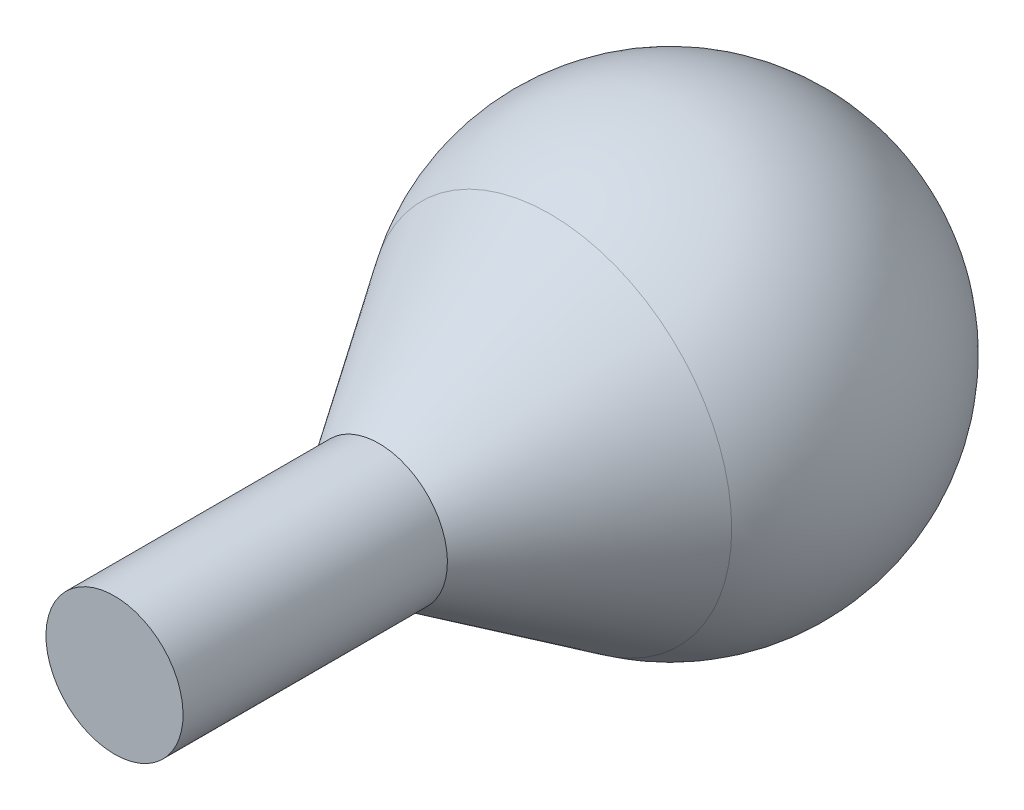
ISO-10303-21;
HEADER;
FILE_DESCRIPTION(('STEP AP214'),'2;1');
FILE_NAME('part.step','',(''),(''),'','','');
FILE_SCHEMA(('AUTOMOTIVE_DESIGN { 1 0 10303 214 1 1 1 1 }'));
ENDSEC;
DATA;
#1=APPLICATION_CONTEXT('core data for automotive mechanical design processes');
#2=APPLICATION_PROTOCOL_DEFINITION('international standard','automotive_design',2000,#1);
#3=PRODUCT_CONTEXT('',#1,'mechanical');
#4=PRODUCT('Part','Part','',(#3));
#5=PRODUCT_RELATED_PRODUCT_CATEGORY('part','',(#4));
#6=PRODUCT_DEFINITION_FORMATION('','',#4);
#7=PRODUCT_DEFINITION_CONTEXT('part definition',#1,'design');
#8=PRODUCT_DEFINITION('design','',#6,#7);
#9=PRODUCT_DEFINITION_SHAPE('','',#8);
#10=(LENGTH_UNIT() NAMED_UNIT(*) SI_UNIT(.MILLI.,.METRE.));
#11=(NAMED_UNIT(*) PLANE_ANGLE_UNIT() SI_UNIT($,.RADIAN.));
#12=(NAMED_UNIT(*) SI_UNIT($,.STERADIAN.) SOLID_ANGLE_UNIT());
#13=UNCERTAINTY_MEASURE_WITH_UNIT(LENGTH_MEASURE(1.E-05),#10,'distance_accuracy_value','');
#14=(GEOMETRIC_REPRESENTATION_CONTEXT(3) GLOBAL_UNCERTAINTY_ASSIGNED_CONTEXT((#13)) GLOBAL_UNIT_ASSIGNED_CONTEXT((#10,
#11,#12)) REPRESENTATION_CONTEXT('',''));
#15=CARTESIAN_POINT('',(0.,0.,0.));
#16=DIRECTION('',(0.,0.,1.));
#17=DIRECTION('',(1.,0.,0.));
#18=AXIS2_PLACEMENT_3D('',#15,#16,#17);
#19=CARTESIAN_POINT('',(0.,0.,0.));
#20=DIRECTION('',(0.,0.,-1.));
#21=DIRECTION('',(0.,1.,0.));
#22=AXIS2_PLACEMENT_3D('',#19,#20,#21);
#23=PLANE('',#22);
#24=CARTESIAN_POINT('',(0.,-7.,0.));
#25=DIRECTION('',(0.,0.,1.));
#26=DIRECTION('',(0.,-1.,0.));
#27=AXIS2_PLACEMENT_3D('',#24,#25,#26);
#28=CIRCLE('',#27,7.);
#29=CARTESIAN_POINT('',(0.,-14.,0.));
#30=VERTEX_POINT('',#29);
#31=EDGE_CURVE('E10',#30,#30,#28,.T.);
#32=ORIENTED_EDGE('',*,*,#31,.T.);
#33=EDGE_LOOP('',(#32));
#34=FACE_BOUND('',#33,.T.);
#35=ADVANCED_FACE('F33',(#34),#23,.F.);
#36=CARTESIAN_POINT('',(0.,-7.,0.));
#37=DIRECTION('',(0.,0.,1.));
#38=DIRECTION('',(0.,-1.,0.));
#39=AXIS2_PLACEMENT_3D('',#36,#37,#38);
#40=CYLINDRICAL_SURFACE('',#39,7.);
#41=ORIENTED_EDGE('',*,*,#31,.F.);
#42=EDGE_LOOP('',(#41));
#43=FACE_BOUND('',#42,.T.);
#44=CARTESIAN_POINT('',(0.,-7.,-27.));
#45=DIRECTION('',(0.,0.,1.));
#46=DIRECTION('',(0.,-1.,0.));
#47=AXIS2_PLACEMENT_3D('',#44,#45,#46);
#48=CIRCLE('',#47,7.);
#49=CARTESIAN_POINT('',(0.,-14.,-27.));
#50=VERTEX_POINT('',#49);
#51=EDGE_CURVE('E39',#50,#50,#48,.T.);
#52=ORIENTED_EDGE('',*,*,#51,.T.);
#53=EDGE_LOOP('',(#52));
#54=FACE_BOUND('',#53,.T.);
#55=ADVANCED_FACE('F58',(#43,#54),#40,.T.);
#56=CARTESIAN_POINT('',(0.,-7.,-44.4758915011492));
#57=DIRECTION('',(0.,0.,-1.));
#58=DIRECTION('',(0.,1.,0.));
#59=AXIS2_PLACEMENT_3D('',#56,#57,#58);
#60=CONICAL_SURFACE('',#59,18.5582531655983,0.584335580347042);
#61=ORIENTED_EDGE('',*,*,#51,.F.);
#62=EDGE_LOOP('',(#61));
#63=FACE_BOUND('',#62,.T.);
#64=CARTESIAN_POINT('',(0.,-7.,-44.4758915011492));
#65=DIRECTION('',(0.,0.,1.));
#66=DIRECTION('',(0.,-1.,0.));
#67=AXIS2_PLACEMENT_3D('',#64,#65,#66);
#68=CIRCLE('',#67,18.5582531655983);
#69=CARTESIAN_POINT('',(0.,-25.5582531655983,-44.4758915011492));
#70=VERTEX_POINT('',#69);
#71=EDGE_CURVE('E43',#70,#70,#68,.T.);
#72=ORIENTED_EDGE('',*,*,#71,.T.);
#73=EDGE_LOOP('',(#72));
#74=FACE_BOUND('',#73,.T.);
#75=ADVANCED_FACE('F50',(#63,#74),#60,.T.);
#76=CARTESIAN_POINT('',(0.,-7.,-56.75));
#77=DIRECTION('',(0.,0.,1.));
#78=DIRECTION('',(0.,1.,0.));
#79=AXIS2_PLACEMENT_3D('',#76,#77,#78);
#80=SPHERICAL_SURFACE('',#79,22.25);
#81=ORIENTED_EDGE('',*,*,#71,.F.);
#82=EDGE_LOOP('',(#81));
#83=FACE_BOUND('',#82,.T.);
#84=ADVANCED_FACE('F52',(#83),#80,.T.);
#85=CLOSED_SHELL('',(#35,#55,#75,#84));
#86=MANIFOLD_SOLID_BREP('B2',#85);
#87=ADVANCED_BREP_SHAPE_REPRESENTATION('',(#18,#86),#14);
#88=SHAPE_DEFINITION_REPRESENTATION(#9,#87);
ENDSEC;
END-ISO-10303-21;
